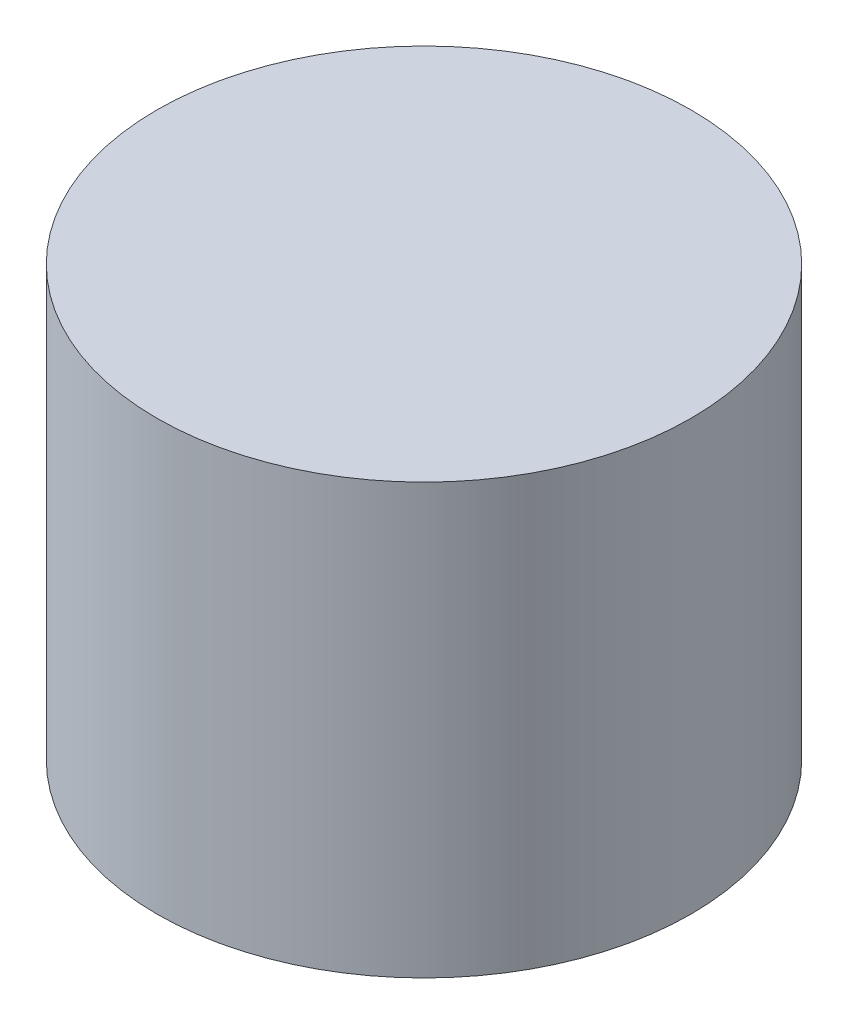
from build123d import *

# Parameters (mm, degrees)
SKETCH1_R           = 12.75
BOSS_EXTRUDE1_DEPTH = 20.5


with BuildPart() as part:
    # Sketch1 → Boss-Extrude1 (new body)
    with BuildSketch(Plane(origin=(0, 0, 0), x_dir=(1, 0, 0), z_dir=(0, 1, 0))):
        with Locations(Location((0, 0, 0), (0, 0, 270))):
            Circle(SKETCH1_R)
    extrude(amount=BOSS_EXTRUDE1_DEPTH)


solid = part.part
